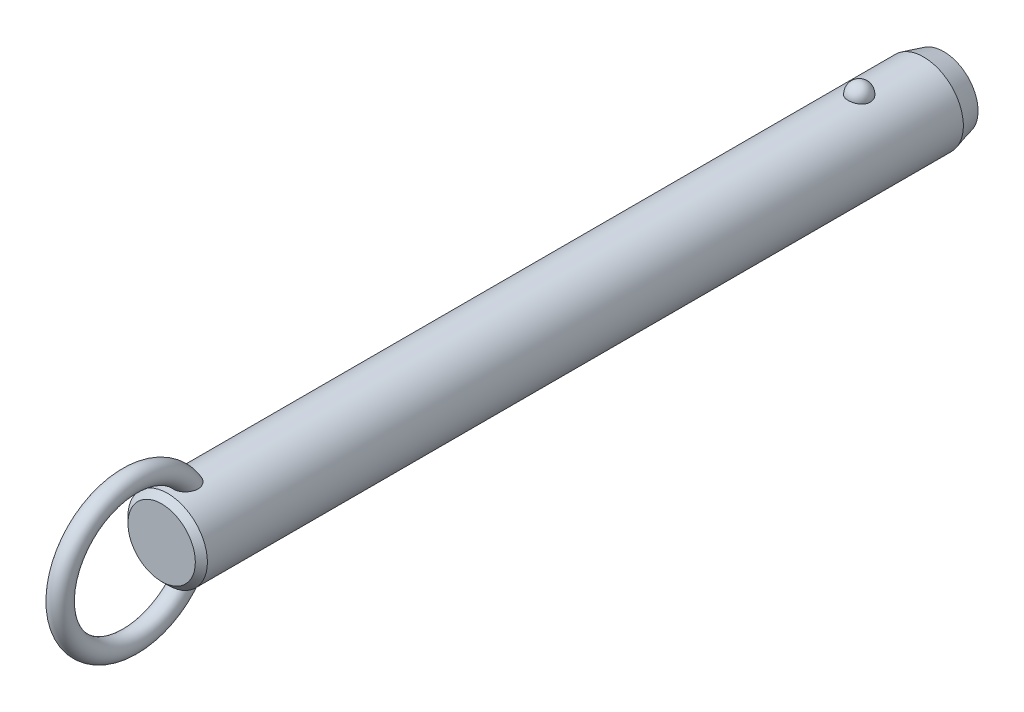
ISO-10303-21;
HEADER;
FILE_DESCRIPTION(('STEP AP214'),'2;1');
FILE_NAME('part.step','',(''),(''),'','','');
FILE_SCHEMA(('AUTOMOTIVE_DESIGN { 1 0 10303 214 1 1 1 1 }'));
ENDSEC;
DATA;
#1=APPLICATION_CONTEXT('core data for automotive mechanical design processes');
#2=APPLICATION_PROTOCOL_DEFINITION('international standard','automotive_design',2000,#1);
#3=PRODUCT_CONTEXT('',#1,'mechanical');
#4=PRODUCT('Part','Part','',(#3));
#5=PRODUCT_RELATED_PRODUCT_CATEGORY('part','',(#4));
#6=PRODUCT_DEFINITION_FORMATION('','',#4);
#7=PRODUCT_DEFINITION_CONTEXT('part definition',#1,'design');
#8=PRODUCT_DEFINITION('design','',#6,#7);
#9=PRODUCT_DEFINITION_SHAPE('','',#8);
#10=(LENGTH_UNIT() NAMED_UNIT(*) SI_UNIT(.MILLI.,.METRE.));
#11=(NAMED_UNIT(*) PLANE_ANGLE_UNIT() SI_UNIT($,.RADIAN.));
#12=(NAMED_UNIT(*) SI_UNIT($,.STERADIAN.) SOLID_ANGLE_UNIT());
#13=UNCERTAINTY_MEASURE_WITH_UNIT(LENGTH_MEASURE(1.E-05),#10,'distance_accuracy_value','');
#14=(GEOMETRIC_REPRESENTATION_CONTEXT(3) GLOBAL_UNCERTAINTY_ASSIGNED_CONTEXT((#13)) GLOBAL_UNIT_ASSIGNED_CONTEXT((#10,
#11,#12)) REPRESENTATION_CONTEXT('',''));
#15=CARTESIAN_POINT('',(0.,0.,0.));
#16=DIRECTION('',(0.,0.,1.));
#17=DIRECTION('',(1.,0.,0.));
#18=AXIS2_PLACEMENT_3D('',#15,#16,#17);
#19=CARTESIAN_POINT('',(0.,0.,127.));
#20=DIRECTION('',(0.,0.,-1.));
#21=DIRECTION('',(-1.,0.,0.));
#22=AXIS2_PLACEMENT_3D('',#19,#20,#21);
#23=CYLINDRICAL_SURFACE('',#22,7.9);
#24=CARTESIAN_POINT('',(2.1785689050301,7.59367088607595,-2.19999999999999));
#25=CARTESIAN_POINT('',(2.17856679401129,7.59367269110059,-2.07701843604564));
#26=CARTESIAN_POINT('',(2.16853481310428,7.59657145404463,-1.95401006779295));
#27=CARTESIAN_POINT('',(2.12864689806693,7.607843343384,-1.71147811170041));
#28=CARTESIAN_POINT('',(2.09878338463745,7.61621856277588,-1.59195587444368));
#29=CARTESIAN_POINT('',(2.0199931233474,7.63749180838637,-1.3598563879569));
#30=CARTESIAN_POINT('',(1.97107475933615,7.6503878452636,-1.24727610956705));
#31=CARTESIAN_POINT('',(1.85539377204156,7.67926115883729,-1.03213234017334));
#32=CARTESIAN_POINT('',(1.78863158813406,7.69523835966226,-0.929568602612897));
#33=CARTESIAN_POINT('',(1.63856494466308,7.7285848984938,-0.736786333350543));
#34=CARTESIAN_POINT('',(1.55518140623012,7.7459606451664,-0.646630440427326));
#35=CARTESIAN_POINT('',(1.37422937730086,7.78009978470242,-0.481747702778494));
#36=CARTESIAN_POINT('',(1.27666086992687,7.79686317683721,-0.407020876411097));
#37=CARTESIAN_POINT('',(1.07024728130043,7.82786153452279,-0.275278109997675));
#38=CARTESIAN_POINT('',(0.961434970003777,7.84210353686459,-0.218212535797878));
#39=CARTESIAN_POINT('',(0.735351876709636,7.86652194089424,-0.123146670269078));
#40=CARTESIAN_POINT('',(0.618082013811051,7.87669878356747,-0.085144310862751));
#41=CARTESIAN_POINT('',(0.380637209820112,7.89170521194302,-0.0298158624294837));
#42=CARTESIAN_POINT('',(0.260550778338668,7.89662650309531,-0.0121347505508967));
#43=CARTESIAN_POINT('',(0.0190117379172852,7.90090003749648,0.00324379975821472));
#44=CARTESIAN_POINT('',(-0.102440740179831,7.90025280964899,0.00094313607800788));
#45=CARTESIAN_POINT('',(-0.341452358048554,7.89351056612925,-0.0233955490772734));
#46=CARTESIAN_POINT('',(-0.459042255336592,7.88749257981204,-0.0451545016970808));
#47=CARTESIAN_POINT('',(-0.688796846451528,7.87075812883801,-0.107408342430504));
#48=CARTESIAN_POINT('',(-0.800961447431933,7.86004158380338,-0.147903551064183));
#49=CARTESIAN_POINT('',(-1.01743634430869,7.83497131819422,-0.246799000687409));
#50=CARTESIAN_POINT('',(-1.12169791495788,7.82059709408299,-0.305300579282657));
#51=CARTESIAN_POINT('',(-1.31891765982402,7.78976470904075,-0.438549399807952));
#52=CARTESIAN_POINT('',(-1.41187469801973,7.77330633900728,-0.513298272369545));
#53=CARTESIAN_POINT('',(-1.58577142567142,7.73972434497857,-0.678622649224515));
#54=CARTESIAN_POINT('',(-1.66645140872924,7.72259402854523,-0.769470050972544));
#55=CARTESIAN_POINT('',(-1.81161503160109,7.68983776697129,-0.963538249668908));
#56=CARTESIAN_POINT('',(-1.87609753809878,7.6742119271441,-1.06675991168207));
#57=CARTESIAN_POINT('',(-1.98790138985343,7.6460202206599,-1.28401170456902));
#58=CARTESIAN_POINT('',(-2.03501994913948,7.63349104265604,-1.39815107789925));
#59=CARTESIAN_POINT('',(-2.10986724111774,7.6131449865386,-1.63301784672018));
#60=CARTESIAN_POINT('',(-2.1375965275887,7.60532797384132,-1.75374505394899));
#61=CARTESIAN_POINT('',(-2.17289256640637,7.5953195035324,-1.99782562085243));
#62=CARTESIAN_POINT('',(-2.18054294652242,7.59310471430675,-2.12116592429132));
#63=CARTESIAN_POINT('',(-2.17572919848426,7.59448538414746,-2.36741799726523));
#64=CARTESIAN_POINT('',(-2.1632656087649,7.59808068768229,-2.49032977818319));
#65=CARTESIAN_POINT('',(-2.11865035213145,7.61064035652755,-2.73161015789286));
#66=CARTESIAN_POINT('',(-2.08659579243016,7.61957823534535,-2.84999812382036));
#67=CARTESIAN_POINT('',(-2.00367799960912,7.64179982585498,-3.07955956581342));
#68=CARTESIAN_POINT('',(-1.9528140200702,7.65508371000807,-3.19073275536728));
#69=CARTESIAN_POINT('',(-1.83321113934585,7.68460381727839,-3.40337899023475));
#70=CARTESIAN_POINT('',(-1.76437735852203,7.70085556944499,-3.50479651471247));
#71=CARTESIAN_POINT('',(-1.61069526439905,7.73445734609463,-3.69446912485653));
#72=CARTESIAN_POINT('',(-1.52584634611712,7.75180741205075,-3.78272371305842));
#73=CARTESIAN_POINT('',(-1.34198059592,7.78574608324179,-3.94393987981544));
#74=CARTESIAN_POINT('',(-1.24291308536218,7.80233167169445,-4.01684434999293));
#75=CARTESIAN_POINT('',(-1.03352039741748,7.83281625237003,-4.14489386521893));
#76=CARTESIAN_POINT('',(-0.92319600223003,7.84671543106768,-4.20004014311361));
#77=CARTESIAN_POINT('',(-0.695822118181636,7.87011575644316,-4.29042017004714));
#78=CARTESIAN_POINT('',(-0.578872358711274,7.87966903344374,-4.32589112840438));
#79=CARTESIAN_POINT('',(-0.340410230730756,7.8935652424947,-4.37692226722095));
#80=CARTESIAN_POINT('',(-0.218898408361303,7.89790879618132,-4.39248482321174));
#81=CARTESIAN_POINT('',(0.0228107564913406,7.90087453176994,-4.40314405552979));
#82=CARTESIAN_POINT('',(0.142990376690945,7.89960185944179,-4.39861683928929));
#83=CARTESIAN_POINT('',(0.380829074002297,7.89171262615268,-4.37008293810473));
#84=CARTESIAN_POINT('',(0.498488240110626,7.8850962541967,-4.34607694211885));
#85=CARTESIAN_POINT('',(0.727535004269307,7.86726442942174,-4.27939317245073));
#86=CARTESIAN_POINT('',(0.838944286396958,7.85606616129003,-4.236785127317));
#87=CARTESIAN_POINT('',(1.05295421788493,7.83025654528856,-4.13408348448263));
#88=CARTESIAN_POINT('',(1.15555431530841,7.81564498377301,-4.07398879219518));
#89=CARTESIAN_POINT('',(1.35076763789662,7.7843022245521,-3.93687432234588));
#90=CARTESIAN_POINT('',(1.4432046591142,7.76754209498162,-3.85961036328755));
#91=CARTESIAN_POINT('',(1.6139111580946,7.73387857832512,-3.69076949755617));
#92=CARTESIAN_POINT('',(1.6921781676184,7.71697516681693,-3.59919010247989));
#93=CARTESIAN_POINT('',(1.83380875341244,7.6845643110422,-3.40247278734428));
#94=CARTESIAN_POINT('',(1.89689280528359,7.66908588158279,-3.29712873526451));
#95=CARTESIAN_POINT('',(2.0047823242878,7.64159441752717,-3.07707931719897));
#96=CARTESIAN_POINT('',(2.0495945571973,7.62958010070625,-2.96237743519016));
#97=CARTESIAN_POINT('',(2.11580183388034,7.61146617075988,-2.74040519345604));
#98=CARTESIAN_POINT('',(2.13929812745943,7.60484503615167,-2.63379846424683));
#99=CARTESIAN_POINT('',(2.17068242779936,7.59594664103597,-2.41813481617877));
#100=CARTESIAN_POINT('',(2.17857077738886,7.59366928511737,-2.30907795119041));
#101=CARTESIAN_POINT('',(2.1785689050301,7.59367088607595,-2.19999999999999));
#102=B_SPLINE_CURVE_WITH_KNOTS('',3,(#24,#25,#26,#27,#28,#29,#30,#31,#32,#33,#34,#35,#36,#37,
#38,#39,#40,#41,#42,#43,#44,#45,#46,#47,#48,#49,#50,#51,#52,#53,#54,#55,#56,#57,#58,#59,#60,#61,
#62,#63,#64,#65,#66,#67,#68,#69,#70,#71,#72,#73,#74,#75,#76,#77,#78,#79,#80,#81,#82,#83,#84,#85,
#86,#87,#88,#89,#90,#91,#92,#93,#94,#95,#96,#97,#98,#99,#100,#101),.UNSPECIFIED.,.T.,.F.,(4,2,2,
2,2,2,2,2,2,2,2,2,2,2,2,2,2,2,2,2,2,2,2,2,2,2,2,2,2,2,2,2,2,2,2,2,2,2,4),(0.,0.368552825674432,
0.737246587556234,1.10577831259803,1.4743009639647,1.8446206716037,2.21494081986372,
2.5842105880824,2.95344028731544,3.31611630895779,3.67875788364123,4.03628044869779,
4.39380913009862,4.75338791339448,5.11300280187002,5.47939989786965,5.8458226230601,
6.21639834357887,6.58696347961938,6.95598276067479,7.32499216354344,7.69218715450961,
8.0593967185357,8.42858578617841,8.79778880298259,9.16834203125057,9.5388695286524,
9.90482699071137,10.2707407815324,10.6298333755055,10.9889132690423,11.3466585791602,
11.7044262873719,12.0676511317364,12.4309391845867,12.8004764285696,13.1698767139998,
13.4967701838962,13.8236564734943),.UNSPECIFIED.);
#103=CARTESIAN_POINT('',(2.1785689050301,7.59367088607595,-2.19999999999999));
#104=VERTEX_POINT('',#103);
#105=EDGE_CURVE('E41',#104,#104,#102,.T.);
#106=ORIENTED_EDGE('',*,*,#105,.T.);
#107=EDGE_LOOP('',(#106));
#108=FACE_BOUND('',#107,.T.);
#109=CARTESIAN_POINT('',(0.,0.,135.32));
#110=DIRECTION('',(0.,0.,1.));
#111=DIRECTION('',(1.,0.,0.));
#112=AXIS2_PLACEMENT_3D('',#109,#110,#111);
#113=CIRCLE('',#112,7.9);
#114=CARTESIAN_POINT('',(7.9,0.,135.32));
#115=VERTEX_POINT('',#114);
#116=EDGE_CURVE('E10',#115,#115,#113,.F.);
#117=ORIENTED_EDGE('',*,*,#116,.T.);
#118=EDGE_LOOP('',(#117));
#119=FACE_BOUND('',#118,.T.);
#120=CARTESIAN_POINT('',(-0.630969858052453,-7.87476203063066,129.212432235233));
#121=CARTESIAN_POINT('',(-0.734180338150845,-7.86648998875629,129.247285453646));
#122=CARTESIAN_POINT('',(-0.83447695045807,-7.85639291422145,129.290816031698));
#123=CARTESIAN_POINT('',(-1.0262035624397,-7.83366343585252,129.394094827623));
#124=CARTESIAN_POINT('',(-1.1176141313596,-7.82102565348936,129.453877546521));
#125=CARTESIAN_POINT('',(-1.28877277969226,-7.79464922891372,129.587839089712));
#126=CARTESIAN_POINT('',(-1.36854014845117,-7.78091246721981,129.661993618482));
#127=CARTESIAN_POINT('',(-1.51461521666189,-7.75380398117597,129.822494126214));
#128=CARTESIAN_POINT('',(-1.58092966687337,-7.74043207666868,129.908833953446));
#129=CARTESIAN_POINT('',(-1.70019064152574,-7.7151252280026,130.092978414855));
#130=CARTESIAN_POINT('',(-1.75284037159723,-7.70322473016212,130.190979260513));
#131=CARTESIAN_POINT('',(-1.84263464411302,-7.68224112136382,130.394102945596));
#132=CARTESIAN_POINT('',(-1.87977299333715,-7.6731591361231,130.499228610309));
#133=CARTESIAN_POINT('',(-1.94152728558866,-7.65777930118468,130.723284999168));
#134=CARTESIAN_POINT('',(-1.96475471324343,-7.65179654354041,130.842616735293));
#135=CARTESIAN_POINT('',(-1.99449499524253,-7.64409642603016,131.08342986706));
#136=CARTESIAN_POINT('',(-2.0010005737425,-7.64238092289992,131.204912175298));
#137=CARTESIAN_POINT('',(-1.99856014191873,-7.64302120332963,131.468340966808));
#138=CARTESIAN_POINT('',(-1.98680021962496,-7.64611845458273,131.61025654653));
#139=CARTESIAN_POINT('',(-1.94457772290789,-7.65696186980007,131.891118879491));
#140=CARTESIAN_POINT('',(-1.91409393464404,-7.66471330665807,132.030062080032));
#141=CARTESIAN_POINT('',(-1.82768670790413,-7.68582947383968,132.331939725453));
#142=CARTESIAN_POINT('',(-1.76772963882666,-7.70003779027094,132.493686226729));
#143=CARTESIAN_POINT('',(-1.65998501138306,-7.72371550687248,132.727695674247));
#144=CARTESIAN_POINT('',(-1.62107967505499,-7.73200670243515,132.804297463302));
#145=CARTESIAN_POINT('',(-1.53727726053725,-7.7491037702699,132.954079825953));
#146=CARTESIAN_POINT('',(-1.49238215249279,-7.75790947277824,133.027261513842));
#147=CARTESIAN_POINT('',(-1.37397050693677,-7.77993338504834,133.20288382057));
#148=CARTESIAN_POINT('',(-1.29690364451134,-7.79328473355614,133.302955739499));
#149=CARTESIAN_POINT('',(-1.12885487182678,-7.81939266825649,133.490714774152));
#150=CARTESIAN_POINT('',(-1.03789926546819,-7.83215032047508,133.578424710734));
#151=CARTESIAN_POINT('',(-0.869532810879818,-7.85231710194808,133.713414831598));
#152=CARTESIAN_POINT('',(-0.795716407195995,-7.86021093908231,133.765076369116));
#153=CARTESIAN_POINT('',(-0.640813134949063,-7.87434920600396,133.856381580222));
#154=CARTESIAN_POINT('',(-0.559737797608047,-7.88059619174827,133.89604389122));
#155=CARTESIAN_POINT('',(-0.406456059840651,-7.88984116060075,133.954300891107));
#156=CARTESIAN_POINT('',(-0.335227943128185,-7.89321892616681,133.975384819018));
#157=CARTESIAN_POINT('',(-0.190193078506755,-7.89804235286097,134.00541418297));
#158=CARTESIAN_POINT('',(-0.116388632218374,-7.89948969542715,134.014370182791));
#159=CARTESIAN_POINT('',(0.0318414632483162,-7.90028409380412,134.019291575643));
#160=CARTESIAN_POINT('',(0.106268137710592,-7.89962640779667,134.015227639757));
#161=CARTESIAN_POINT('',(0.253290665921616,-7.8962818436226,133.994461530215));
#162=CARTESIAN_POINT('',(0.325885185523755,-7.8935935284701,133.977750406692));
#163=CARTESIAN_POINT('',(0.481441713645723,-7.88577340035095,133.928738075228));
#164=CARTESIAN_POINT('',(0.563611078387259,-7.88026321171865,133.894005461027));
#165=CARTESIAN_POINT('',(0.721129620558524,-7.86741729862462,133.811796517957));
#166=CARTESIAN_POINT('',(0.796466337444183,-7.86007832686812,133.764297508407));
#167=CARTESIAN_POINT('',(0.971456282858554,-7.84073285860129,133.636513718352));
#168=CARTESIAN_POINT('',(1.06719686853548,-7.82809461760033,133.551004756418));
#169=CARTESIAN_POINT('',(1.24418921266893,-7.80192439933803,133.366232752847));
#170=CARTESIAN_POINT('',(1.32540832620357,-7.78839049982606,133.266939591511));
#171=CARTESIAN_POINT('',(1.45199971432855,-7.76559693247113,133.089576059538));
#172=CARTESIAN_POINT('',(1.50085649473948,-7.75626094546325,133.013954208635));
#173=CARTESIAN_POINT('',(1.59197749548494,-7.73807279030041,132.858742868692));
#174=CARTESIAN_POINT('',(1.63423919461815,-7.72922080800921,132.779151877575));
#175=CARTESIAN_POINT('',(1.71222612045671,-7.71231959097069,132.616664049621));
#176=CARTESIAN_POINT('',(1.74794516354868,-7.70427111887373,132.533764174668));
#177=CARTESIAN_POINT('',(1.81270113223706,-7.68929240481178,132.365296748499));
#178=CARTESIAN_POINT('',(1.84173789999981,-7.68236218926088,132.279729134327));
#179=CARTESIAN_POINT('',(1.89322698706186,-7.6698375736,132.10528702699));
#180=CARTESIAN_POINT('',(1.91558744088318,-7.66426199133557,132.016383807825));
#181=CARTESIAN_POINT('',(1.95281367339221,-7.65485915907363,131.836969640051));
#182=CARTESIAN_POINT('',(1.96767946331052,-7.65103190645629,131.746458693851));
#183=CARTESIAN_POINT('',(2.0002145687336,-7.64262981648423,131.473732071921));
#184=CARTESIAN_POINT('',(2.00600691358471,-7.6410871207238,131.289709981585));
#185=CARTESIAN_POINT('',(1.98445334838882,-7.64669564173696,130.976501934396));
#186=CARTESIAN_POINT('',(1.96607186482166,-7.65149688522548,130.846618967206));
#187=CARTESIAN_POINT('',(1.90884967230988,-7.66597624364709,130.591632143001));
#188=CARTESIAN_POINT('',(1.87002101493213,-7.67565148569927,130.466525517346));
#189=CARTESIAN_POINT('',(1.77063986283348,-7.69918471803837,130.22454013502));
#190=CARTESIAN_POINT('',(1.70993724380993,-7.71307150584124,130.107725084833));
#191=CARTESIAN_POINT('',(1.56733070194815,-7.74330306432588,129.888144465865));
#192=CARTESIAN_POINT('',(1.48543692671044,-7.75964665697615,129.785372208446));
#193=CARTESIAN_POINT('',(1.31346177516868,-7.79047523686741,129.609380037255));
#194=CARTESIAN_POINT('',(1.22547278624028,-7.80495298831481,129.534106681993));
#195=CARTESIAN_POINT('',(1.03724352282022,-7.83218597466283,129.400486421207));
#196=CARTESIAN_POINT('',(0.93700840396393,-7.84494192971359,129.342132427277));
#197=CARTESIAN_POINT('',(0.733599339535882,-7.86649045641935,129.247027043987));
#198=CARTESIAN_POINT('',(0.630941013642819,-7.87547134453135,129.209210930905));
#199=CARTESIAN_POINT('',(0.420465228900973,-7.88950708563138,129.151116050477));
#200=CARTESIAN_POINT('',(0.31264590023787,-7.89456050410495,129.13084369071));
#201=CARTESIAN_POINT('',(0.0960869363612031,-7.9001518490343,129.108455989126));
#202=CARTESIAN_POINT('',(-0.0126341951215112,-7.90073226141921,129.106169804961));
#203=CARTESIAN_POINT('',(-0.228766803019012,-7.89742350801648,129.119367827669));
#204=CARTESIAN_POINT('',(-0.336180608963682,-7.89354403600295,129.134813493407));
#205=CARTESIAN_POINT('',(-0.473410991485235,-7.88586871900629,129.166217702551));
#206=CARTESIAN_POINT('',(-0.50525779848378,-7.88388984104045,129.174354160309));
#207=CARTESIAN_POINT('',(-0.56848128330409,-7.87958326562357,129.192208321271));
#208=CARTESIAN_POINT('',(-0.59985795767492,-7.87725556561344,129.201926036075));
#209=CARTESIAN_POINT('',(-0.630969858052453,-7.87476203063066,129.212432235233));
#210=B_SPLINE_CURVE_WITH_KNOTS('',3,(#120,#121,#122,#123,#124,#125,#126,#127,#128,#129,#130,
#131,#132,#133,#134,#135,#136,#137,#138,#139,#140,#141,#142,#143,#144,#145,#146,#147,#148,#149,
#150,#151,#152,#153,#154,#155,#156,#157,#158,#159,#160,#161,#162,#163,#164,#165,#166,#167,#168,
#169,#170,#171,#172,#173,#174,#175,#176,#177,#178,#179,#180,#181,#182,#183,#184,#185,#186,#187,
#188,#189,#190,#191,#192,#193,#194,#195,#196,#197,#198,#199,#200,#201,#202,#203,#204,#205,#206,
#207,#208,#209),.UNSPECIFIED.,.T.,.F.,(4,2,2,2,2,2,2,2,2,2,2,2,2,2,2,2,2,2,2,2,2,2,2,2,2,2,2,2,
2,2,2,2,2,2,2,2,2,2,2,2,2,2,2,2,4),(0.,0.327622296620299,0.655945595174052,0.983718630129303,
1.3113267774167,1.64554655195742,1.97989964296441,2.34365728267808,2.70757317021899,
3.13333684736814,3.5595838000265,4.07655306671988,4.33527897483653,4.59391999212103,
4.97382437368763,5.353017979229,5.62348245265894,5.89352465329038,6.11565959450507,
6.33760092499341,6.56004255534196,6.78264174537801,7.0493084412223,7.31645206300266,
7.70130871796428,8.08701995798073,8.35824509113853,8.6295736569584,8.9011573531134,
9.1727474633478,9.44791855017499,9.72308922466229,10.2715298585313,10.6638393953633,
11.0559179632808,11.4507403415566,11.8453740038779,12.1936425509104,12.5417649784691,
12.8695063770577,13.1973674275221,13.5221104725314,13.8461490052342,13.9449071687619,
14.0436660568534),.UNSPECIFIED.);
#211=CARTESIAN_POINT('',(-0.630969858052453,-7.87476203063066,129.212432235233));
#212=VERTEX_POINT('',#211);
#213=EDGE_CURVE('E59',#212,#212,#210,.T.);
#214=ORIENTED_EDGE('',*,*,#213,.T.);
#215=EDGE_LOOP('',(#214));
#216=FACE_BOUND('',#215,.T.);
#217=CARTESIAN_POINT('',(-0.630969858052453,7.87476203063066,129.212432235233));
#218=CARTESIAN_POINT('',(-0.528918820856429,7.88293636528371,129.177979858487));
#219=CARTESIAN_POINT('',(-0.423745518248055,7.88934810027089,129.151915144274));
#220=CARTESIAN_POINT('',(-0.210236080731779,7.8979273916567,129.117282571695));
#221=CARTESIAN_POINT('',(-0.10189380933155,7.90008607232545,129.108751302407));
#222=CARTESIAN_POINT('',(0.114660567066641,7.89990877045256,129.109457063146));
#223=CARTESIAN_POINT('',(0.222872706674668,7.89757640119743,129.11867980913));
#224=CARTESIAN_POINT('',(0.436107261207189,7.88867538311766,129.154652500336));
#225=CARTESIAN_POINT('',(0.541131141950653,7.8821087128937,129.18139425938));
#226=CARTESIAN_POINT('',(0.745085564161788,7.86545130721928,129.251756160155));
#227=CARTESIAN_POINT('',(0.844015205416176,7.85536005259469,129.295378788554));
#228=CARTESIAN_POINT('',(1.03299167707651,7.83275153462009,129.398379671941));
#229=CARTESIAN_POINT('',(1.12303841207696,7.8202342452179,129.457758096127));
#230=CARTESIAN_POINT('',(1.29214734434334,7.79408219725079,129.590864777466));
#231=CARTESIAN_POINT('',(1.37116907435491,7.78044359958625,129.664643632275));
#232=CARTESIAN_POINT('',(1.51597677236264,7.75353170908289,129.824235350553));
#233=CARTESIAN_POINT('',(1.58176261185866,7.74025841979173,129.910048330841));
#234=CARTESIAN_POINT('',(1.70057386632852,7.71504069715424,130.093644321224));
#235=CARTESIAN_POINT('',(1.75320073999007,7.7031425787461,130.191690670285));
#236=CARTESIAN_POINT('',(1.8429376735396,7.68216822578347,130.394893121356));
#237=CARTESIAN_POINT('',(1.88004278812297,7.67309289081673,130.500051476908));
#238=CARTESIAN_POINT('',(1.9417232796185,7.6577294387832,130.724167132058));
#239=CARTESIAN_POINT('',(1.96491037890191,7.65175648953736,130.843524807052));
#240=CARTESIAN_POINT('',(1.9945689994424,7.64407702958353,131.084384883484));
#241=CARTESIAN_POINT('',(2.00103304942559,7.64237242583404,131.20588821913));
#242=CARTESIAN_POINT('',(1.99850166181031,7.64303650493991,131.469368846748));
#243=CARTESIAN_POINT('',(1.98669038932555,7.64614714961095,131.611314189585));
#244=CARTESIAN_POINT('',(1.94436120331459,7.6570170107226,131.892228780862));
#245=CARTESIAN_POINT('',(1.91382203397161,7.66478150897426,132.031194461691));
#246=CARTESIAN_POINT('',(1.82728754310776,7.68592483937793,132.333111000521));
#247=CARTESIAN_POINT('',(1.76725778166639,7.7001468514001,132.494872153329));
#248=CARTESIAN_POINT('',(1.65939700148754,7.72384204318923,132.728891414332));
#249=CARTESIAN_POINT('',(1.62045187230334,7.73213852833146,132.805494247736));
#250=CARTESIAN_POINT('',(1.53656684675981,7.74924489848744,132.955273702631));
#251=CARTESIAN_POINT('',(1.49162892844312,7.75805461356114,133.028451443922));
#252=CARTESIAN_POINT('',(1.37317698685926,7.78007342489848,133.203952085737));
#253=CARTESIAN_POINT('',(1.29612360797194,7.79341423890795,133.303911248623));
#254=CARTESIAN_POINT('',(1.12812043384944,7.81949839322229,133.49145083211));
#255=CARTESIAN_POINT('',(1.03719688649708,7.83224280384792,133.579054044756));
#256=CARTESIAN_POINT('',(0.868871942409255,7.85239026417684,133.71389715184));
#257=CARTESIAN_POINT('',(0.795056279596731,7.86027769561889,133.765511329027));
#258=CARTESIAN_POINT('',(0.640160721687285,7.87440222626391,133.856720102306));
#259=CARTESIAN_POINT('',(0.559092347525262,7.88064188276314,133.896333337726));
#260=CARTESIAN_POINT('',(0.405820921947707,7.8898738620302,133.954505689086));
#261=CARTESIAN_POINT('',(0.334594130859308,7.89324577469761,133.975552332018));
#262=CARTESIAN_POINT('',(0.189568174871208,7.89805733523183,134.005507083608));
#263=CARTESIAN_POINT('',(0.115771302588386,7.89949866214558,134.014425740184));
#264=CARTESIAN_POINT('',(-0.0324359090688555,7.90028156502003,134.01927589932));
#265=CARTESIAN_POINT('',(-0.106847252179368,7.89961843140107,134.015178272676));
#266=CARTESIAN_POINT('',(-0.253834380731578,7.8962642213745,133.994351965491));
#267=CARTESIAN_POINT('',(-0.326408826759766,7.89357170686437,133.977614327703));
#268=CARTESIAN_POINT('',(-0.481962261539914,7.88574179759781,133.928539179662));
#269=CARTESIAN_POINT('',(-0.564145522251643,7.88022507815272,133.893763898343));
#270=CARTESIAN_POINT('',(-0.721685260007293,7.86736646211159,133.811468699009));
#271=CARTESIAN_POINT('',(-0.797029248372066,7.8600213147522,133.763926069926));
#272=CARTESIAN_POINT('',(-0.9720442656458,7.84066026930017,133.636026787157));
#273=CARTESIAN_POINT('',(-1.06779803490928,7.82801274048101,133.550443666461));
#274=CARTESIAN_POINT('',(-1.2448053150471,7.80182621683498,133.365522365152));
#275=CARTESIAN_POINT('',(-1.32602618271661,7.78828530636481,133.266154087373));
#276=CARTESIAN_POINT('',(-1.45259834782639,7.76548487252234,133.088680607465));
#277=CARTESIAN_POINT('',(-1.50143856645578,7.75614818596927,133.013025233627));
#278=CARTESIAN_POINT('',(-1.59252410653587,7.73796020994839,132.857748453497));
#279=CARTESIAN_POINT('',(-1.63476690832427,7.72910910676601,132.778125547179));
#280=CARTESIAN_POINT('',(-1.71271318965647,7.71221133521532,132.615575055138));
#281=CARTESIAN_POINT('',(-1.74841047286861,7.70416543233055,132.532644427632));
#282=CARTESIAN_POINT('',(-1.81311929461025,7.6891937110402,132.364116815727));
#283=CARTESIAN_POINT('',(-1.84213067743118,7.68226791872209,132.278519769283));
#284=CARTESIAN_POINT('',(-1.89356259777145,7.66975461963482,132.104025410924));
#285=CARTESIAN_POINT('',(-1.91589165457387,7.66418586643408,132.015099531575));
#286=CARTESIAN_POINT('',(-1.9530507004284,7.65479859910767,131.835642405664));
#287=CARTESIAN_POINT('',(-1.96788069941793,7.65098008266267,131.745111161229));
#288=CARTESIAN_POINT('',(-2.00030078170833,7.64260704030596,131.472327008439));
#289=CARTESIAN_POINT('',(-2.00600576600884,7.64108760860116,131.288271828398));
#290=CARTESIAN_POINT('',(-1.9842848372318,7.64673945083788,130.975080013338));
#291=CARTESIAN_POINT('',(-1.96583698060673,7.65155751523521,130.845240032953));
#292=CARTESIAN_POINT('',(-1.90848948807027,7.66606613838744,130.590361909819));
#293=CARTESIAN_POINT('',(-1.86960376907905,7.67575338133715,130.465320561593));
#294=CARTESIAN_POINT('',(-1.77013421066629,7.6993013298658,130.223500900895));
#295=CARTESIAN_POINT('',(-1.70940488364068,7.71318991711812,130.106784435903));
#296=CARTESIAN_POINT('',(-1.56672953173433,7.74342495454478,129.887340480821));
#297=CARTESIAN_POINT('',(-1.48478316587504,7.75977144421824,129.78461321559));
#298=CARTESIAN_POINT('',(-1.31266325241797,7.79061163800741,129.608643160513));
#299=CARTESIAN_POINT('',(-1.22456383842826,7.80509908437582,129.533358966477));
#300=CARTESIAN_POINT('',(-1.03622400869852,7.83231881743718,129.399865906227));
#301=CARTESIAN_POINT('',(-0.936015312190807,7.84505551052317,129.341613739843));
#302=CARTESIAN_POINT('',(-0.798824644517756,7.85957802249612,129.277540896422));
#303=CARTESIAN_POINT('',(-0.765787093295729,7.86286821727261,129.263224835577));
#304=CARTESIAN_POINT('',(-0.698939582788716,7.86909211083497,129.236436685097));
#305=CARTESIAN_POINT('',(-0.66512963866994,7.8720258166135,129.223964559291));
#306=CARTESIAN_POINT('',(-0.630969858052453,7.87476203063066,129.212432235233));
#307=B_SPLINE_CURVE_WITH_KNOTS('',3,(#217,#218,#219,#220,#221,#222,#223,#224,#225,#226,#227,
#228,#229,#230,#231,#232,#233,#234,#235,#236,#237,#238,#239,#240,#241,#242,#243,#244,#245,#246,
#247,#248,#249,#250,#251,#252,#253,#254,#255,#256,#257,#258,#259,#260,#261,#262,#263,#264,#265,
#266,#267,#268,#269,#270,#271,#272,#273,#274,#275,#276,#277,#278,#279,#280,#281,#282,#283,#284,
#285,#286,#287,#288,#289,#290,#291,#292,#293,#294,#295,#296,#297,#298,#299,#300,#301,#302,#303,
#304,#305,#306),.UNSPECIFIED.,.T.,.F.,(4,2,2,2,2,2,2,2,2,2,2,2,2,2,2,2,2,2,2,2,2,2,2,2,2,2,2,2,
2,2,2,2,2,2,2,2,2,2,2,2,2,2,2,2,4),(0.,0.323920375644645,0.648516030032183,0.972850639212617,
1.29703380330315,1.62126473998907,1.94549915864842,2.27089401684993,2.5962920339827,
2.93059633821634,3.26500707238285,3.6288164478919,3.99278833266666,4.4186542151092,
4.84500434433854,5.36209210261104,5.62087589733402,5.87957448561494,6.25918598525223,
6.63808782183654,6.90846748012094,7.17842501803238,7.40052350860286,7.6224287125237,
7.84483086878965,8.0673907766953,8.33414615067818,8.60137921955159,8.98641454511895,
9.37230415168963,9.64358673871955,9.91497268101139,10.1866142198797,10.4582620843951,
10.7334745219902,11.008686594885,11.5572126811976,11.9494246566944,12.3413699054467,
12.7359755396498,13.1305875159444,13.4791770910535,13.82687259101,13.9353013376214,
14.0437279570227),.UNSPECIFIED.);
#308=CARTESIAN_POINT('',(-0.630969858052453,7.87476203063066,129.212432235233));
#309=VERTEX_POINT('',#308);
#310=EDGE_CURVE('E67',#309,#309,#307,.T.);
#311=ORIENTED_EDGE('',*,*,#310,.T.);
#312=EDGE_LOOP('',(#311));
#313=FACE_BOUND('',#312,.T.);
#314=CARTESIAN_POINT('',(0.,0.,-14.9999999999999));
#315=DIRECTION('',(0.,0.,-1.));
#316=DIRECTION('',(-1.,0.,0.));
#317=AXIS2_PLACEMENT_3D('',#314,#315,#316);
#318=CIRCLE('',#317,7.9);
#319=CARTESIAN_POINT('',(-7.9,0.,-14.9999999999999));
#320=VERTEX_POINT('',#319);
#321=EDGE_CURVE('E56',#320,#320,#318,.F.);
#322=ORIENTED_EDGE('',*,*,#321,.T.);
#323=EDGE_LOOP('',(#322));
#324=FACE_BOUND('',#323,.T.);
#325=ADVANCED_FACE('F37',(#108,#119,#216,#313,#324),#23,.T.);
#326=CARTESIAN_POINT('',(0.,0.,-19.));
#327=DIRECTION('',(0.,0.,-1.));
#328=DIRECTION('',(-1.,0.,0.));
#329=AXIS2_PLACEMENT_3D('',#326,#327,#328);
#330=PLANE('',#329);
#331=CARTESIAN_POINT('',(0.,0.,-19.));
#332=DIRECTION('',(0.,0.,-1.));
#333=DIRECTION('',(-1.,0.,0.));
#334=AXIS2_PLACEMENT_3D('',#331,#332,#333);
#335=CIRCLE('',#334,6.8282032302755);
#336=CARTESIAN_POINT('',(-6.8282032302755,0.,-19.));
#337=VERTEX_POINT('',#336);
#338=EDGE_CURVE('E66',#337,#337,#335,.T.);
#339=ORIENTED_EDGE('',*,*,#338,.T.);
#340=EDGE_LOOP('',(#339));
#341=FACE_BOUND('',#340,.T.);
#342=ADVANCED_FACE('F85',(#341),#330,.T.);
#343=CARTESIAN_POINT('',(0.,0.,-19.));
#344=DIRECTION('',(0.,0.,1.));
#345=DIRECTION('',(1.,0.,0.));
#346=AXIS2_PLACEMENT_3D('',#343,#344,#345);
#347=CONICAL_SURFACE('',#346,6.8282032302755,0.261799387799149);
#348=ORIENTED_EDGE('',*,*,#321,.F.);
#349=EDGE_LOOP('',(#348));
#350=FACE_BOUND('',#349,.T.);
#351=ORIENTED_EDGE('',*,*,#338,.F.);
#352=EDGE_LOOP('',(#351));
#353=FACE_BOUND('',#352,.T.);
#354=ADVANCED_FACE('F83',(#350,#353),#347,.T.);
#355=CARTESIAN_POINT('',(0.,0.,136.52));
#356=DIRECTION('',(0.,0.,1.));
#357=DIRECTION('',(1.,0.,0.));
#358=AXIS2_PLACEMENT_3D('',#355,#356,#357);
#359=PLANE('',#358);
#360=CARTESIAN_POINT('',(0.,0.,136.52));
#361=DIRECTION('',(0.,0.,1.));
#362=DIRECTION('',(1.,0.,0.));
#363=AXIS2_PLACEMENT_3D('',#360,#361,#362);
#364=CIRCLE('',#363,6.69999999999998);
#365=CARTESIAN_POINT('',(6.69999999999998,0.,136.52));
#366=VERTEX_POINT('',#365);
#367=EDGE_CURVE('E50',#366,#366,#364,.T.);
#368=ORIENTED_EDGE('',*,*,#367,.T.);
#369=EDGE_LOOP('',(#368));
#370=FACE_BOUND('',#369,.T.);
#371=ADVANCED_FACE('F77',(#370),#359,.T.);
#372=CARTESIAN_POINT('',(0.,0.,142.85));
#373=DIRECTION('',(1.,0.,0.));
#374=DIRECTION('',(0.,0.,-1.));
#375=AXIS2_PLACEMENT_3D('',#372,#373,#374);
#376=TOROIDAL_SURFACE('',#375,13.85,2.);
#377=ORIENTED_EDGE('',*,*,#310,.F.);
#378=EDGE_LOOP('',(#377));
#379=FACE_BOUND('',#378,.T.);
#380=ORIENTED_EDGE('',*,*,#213,.F.);
#381=EDGE_LOOP('',(#380));
#382=FACE_BOUND('',#381,.T.);
#383=ADVANCED_FACE('F73',(#379,#382),#376,.T.);
#384=CARTESIAN_POINT('',(0.,0.,136.52));
#385=DIRECTION('',(0.,0.,-1.));
#386=DIRECTION('',(-1.,0.,0.));
#387=AXIS2_PLACEMENT_3D('',#384,#385,#386);
#388=CONICAL_SURFACE('',#387,6.69999999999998,0.785398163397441);
#389=ORIENTED_EDGE('',*,*,#116,.F.);
#390=EDGE_LOOP('',(#389));
#391=FACE_BOUND('',#390,.T.);
#392=ORIENTED_EDGE('',*,*,#367,.F.);
#393=EDGE_LOOP('',(#392));
#394=FACE_BOUND('',#393,.T.);
#395=ADVANCED_FACE('F39',(#391,#394),#388,.T.);
#396=CARTESIAN_POINT('',(0.,7.9,-2.19999999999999));
#397=DIRECTION('',(0.,1.,0.));
#398=DIRECTION('',(0.,0.,-1.));
#399=AXIS2_PLACEMENT_3D('',#396,#397,#398);
#400=SPHERICAL_SURFACE('',#399,2.2);
#401=ORIENTED_EDGE('',*,*,#105,.F.);
#402=EDGE_LOOP('',(#401));
#403=FACE_BOUND('',#402,.T.);
#404=ADVANCED_FACE('F79',(#403),#400,.T.);
#405=CLOSED_SHELL('',(#325,#342,#354,#371,#383,#395,#404));
#406=MANIFOLD_SOLID_BREP('B2',#405);
#407=ADVANCED_BREP_SHAPE_REPRESENTATION('',(#18,#406),#14);
#408=SHAPE_DEFINITION_REPRESENTATION(#9,#407);
ENDSEC;
END-ISO-10303-21;
